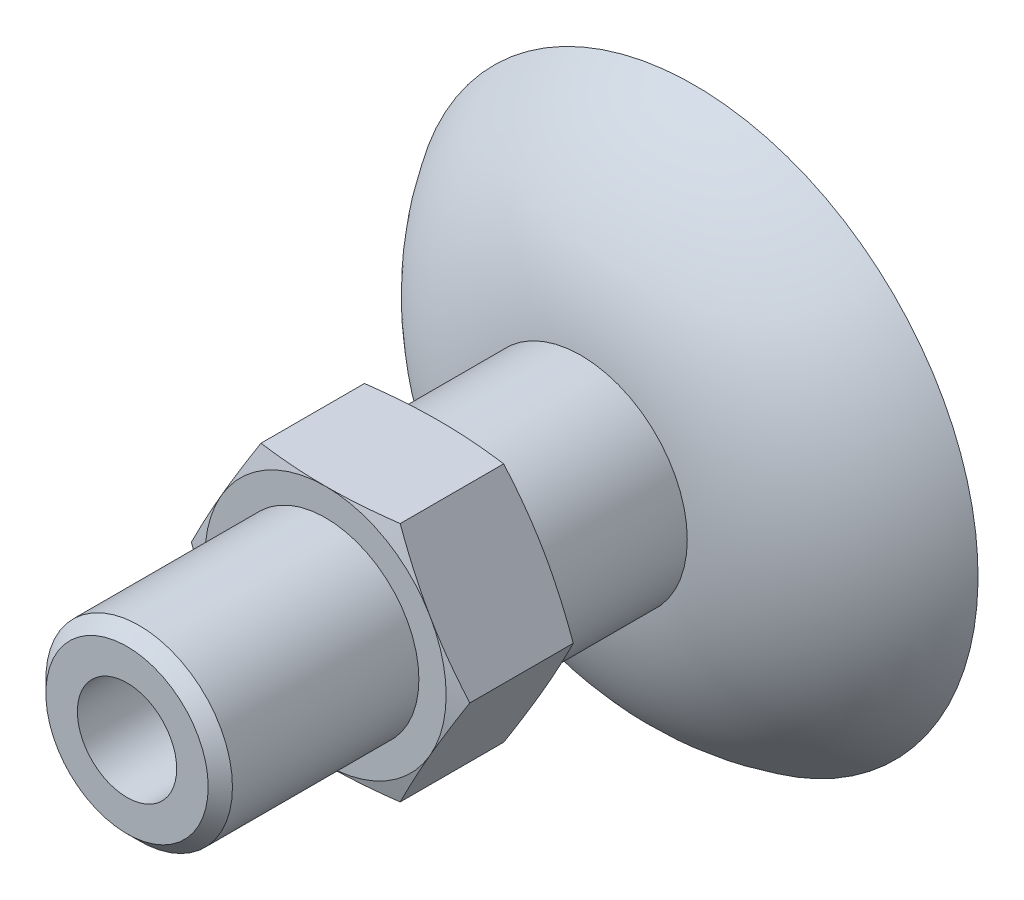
ISO-10303-21;
HEADER;
FILE_DESCRIPTION(('STEP AP214'),'2;1');
FILE_NAME('part.step','',(''),(''),'','','');
FILE_SCHEMA(('AUTOMOTIVE_DESIGN { 1 0 10303 214 1 1 1 1 }'));
ENDSEC;
DATA;
#1=APPLICATION_CONTEXT('core data for automotive mechanical design processes');
#2=APPLICATION_PROTOCOL_DEFINITION('international standard','automotive_design',2000,#1);
#3=PRODUCT_CONTEXT('',#1,'mechanical');
#4=PRODUCT('Part','Part','',(#3));
#5=PRODUCT_RELATED_PRODUCT_CATEGORY('part','',(#4));
#6=PRODUCT_DEFINITION_FORMATION('','',#4);
#7=PRODUCT_DEFINITION_CONTEXT('part definition',#1,'design');
#8=PRODUCT_DEFINITION('design','',#6,#7);
#9=PRODUCT_DEFINITION_SHAPE('','',#8);
#10=(LENGTH_UNIT() NAMED_UNIT(*) SI_UNIT(.MILLI.,.METRE.));
#11=(NAMED_UNIT(*) PLANE_ANGLE_UNIT() SI_UNIT($,.RADIAN.));
#12=(NAMED_UNIT(*) SI_UNIT($,.STERADIAN.) SOLID_ANGLE_UNIT());
#13=UNCERTAINTY_MEASURE_WITH_UNIT(LENGTH_MEASURE(1.E-05),#10,'distance_accuracy_value','');
#14=(GEOMETRIC_REPRESENTATION_CONTEXT(3) GLOBAL_UNCERTAINTY_ASSIGNED_CONTEXT((#13)) GLOBAL_UNIT_ASSIGNED_CONTEXT((#10,
#11,#12)) REPRESENTATION_CONTEXT('',''));
#15=CARTESIAN_POINT('',(0.,0.,0.));
#16=DIRECTION('',(0.,0.,1.));
#17=DIRECTION('',(1.,0.,0.));
#18=AXIS2_PLACEMENT_3D('',#15,#16,#17);
#19=CARTESIAN_POINT('',(9.81495457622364,0.,18.));
#20=DIRECTION('',(0.866025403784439,0.5,0.));
#21=DIRECTION('',(0.,0.,1.));
#22=AXIS2_PLACEMENT_3D('',#19,#20,#21);
#23=PLANE('',#22);
#24=DIRECTION('',(0.,0.,1.));
#25=VECTOR('',#24,1.);
#26=CARTESIAN_POINT('',(4.90747728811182,8.5,18.));
#27=LINE('',#26,#25);
#28=CARTESIAN_POINT('',(4.90747728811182,8.5,18.3523410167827));
#29=VERTEX_POINT('',#28);
#30=CARTESIAN_POINT('',(4.90747728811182,8.5,25.6476589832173));
#31=VERTEX_POINT('',#30);
#32=EDGE_CURVE('E449',#29,#31,#27,.T.);
#33=ORIENTED_EDGE('',*,*,#32,.T.);
#34=CARTESIAN_POINT('',(7.36121593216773,4.25000000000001,26.));
#35=CARTESIAN_POINT('',(7.25906175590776,4.42681371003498,26.0000283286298));
#36=CARTESIAN_POINT('',(7.15683049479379,4.60358298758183,25.9980853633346));
#37=CARTESIAN_POINT('',(6.95297562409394,4.95616774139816,25.9903015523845));
#38=CARTESIAN_POINT('',(6.85135160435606,5.1319834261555,25.9844809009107));
#39=CARTESIAN_POINT('',(6.64789890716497,5.4845122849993,25.9689468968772));
#40=CARTESIAN_POINT('',(6.54607179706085,5.66122549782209,25.9592139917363));
#41=CARTESIAN_POINT('',(6.34102365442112,6.01708320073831,25.9359159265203));
#42=CARTESIAN_POINT('',(6.23780425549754,6.19622503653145,25.92229626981));
#43=CARTESIAN_POINT('',(6.03399427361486,6.54934217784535,25.8919827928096));
#44=CARTESIAN_POINT('',(5.93340724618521,6.72332747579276,25.8753809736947));
#45=CARTESIAN_POINT('',(5.73149806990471,7.07269913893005,25.8388368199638));
#46=CARTESIAN_POINT('',(5.63017779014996,7.24808347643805,25.8188648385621));
#47=CARTESIAN_POINT('',(5.42622044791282,7.60127476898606,25.7756107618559));
#48=CARTESIAN_POINT('',(5.32358676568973,7.77907804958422,25.7522829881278));
#49=CARTESIAN_POINT('',(5.11643524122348,8.13798036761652,25.7023308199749));
#50=CARTESIAN_POINT('',(5.01192109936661,8.3190736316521,25.6756494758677));
#51=CARTESIAN_POINT('',(4.90747728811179,8.49999999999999,25.6476589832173));
#52=B_SPLINE_CURVE_WITH_KNOTS('',3,(#34,#35,#36,#37,#38,#39,#40,#41,#42,#43,#44,#45,#46,#47,#48,
#49,#50,#51),.UNSPECIFIED.,.F.,.F.,(4,2,2,2,2,2,2,2,4),(0.,0.612597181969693,1.22202876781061,
1.83454479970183,2.45611071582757,3.0610462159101,3.67161078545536,4.29145119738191,
4.92377991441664),.UNSPECIFIED.);
#53=CARTESIAN_POINT('',(7.36121593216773,4.25,26.));
#54=VERTEX_POINT('',#53);
#55=EDGE_CURVE('E482',#54,#31,#52,.T.);
#56=ORIENTED_EDGE('',*,*,#55,.F.);
#57=CARTESIAN_POINT('',(9.81495457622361,0.,25.6476589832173));
#58=CARTESIAN_POINT('',(9.71049903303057,0.180898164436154,25.6756469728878));
#59=CARTESIAN_POINT('',(9.60593547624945,0.36194148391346,25.7023256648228));
#60=CARTESIAN_POINT('',(9.39870838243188,0.720772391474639,25.7522744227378));
#61=CARTESIAN_POINT('',(9.29604797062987,0.898553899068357,25.7756012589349));
#62=CARTESIAN_POINT('',(9.09215663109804,1.25178452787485,25.8188552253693));
#63=CARTESIAN_POINT('',(8.99092720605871,1.42722891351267,25.8388278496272));
#64=CARTESIAN_POINT('',(8.78930184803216,1.77679219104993,25.875375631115));
#65=CARTESIAN_POINT('',(8.68890677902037,1.95090849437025,25.8919802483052));
#66=CARTESIAN_POINT('',(8.48499517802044,2.30396626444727,25.9222962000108));
#67=CARTESIAN_POINT('',(8.38146828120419,2.48290963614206,25.9359161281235));
#68=CARTESIAN_POINT('',(8.1758194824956,2.83839265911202,25.9592144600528));
#69=CARTESIAN_POINT('',(8.07369897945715,3.01492953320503,25.9689471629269));
#70=CARTESIAN_POINT('',(7.87012962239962,3.36739105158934,25.9844810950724));
#71=CARTESIAN_POINT('',(7.7686799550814,3.54331437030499,25.9903016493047));
#72=CARTESIAN_POINT('',(7.56525161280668,3.89617326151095,25.9980854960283));
#73=CARTESIAN_POINT('',(7.46327295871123,4.07310929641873,26.0000283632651));
#74=CARTESIAN_POINT('',(7.36121593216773,4.25000000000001,26.));
#75=B_SPLINE_CURVE_WITH_KNOTS('',3,(#57,#58,#59,#60,#61,#62,#63,#64,#65,#66,#67,#68,#69,#70,#71,
#72,#73,#74),.UNSPECIFIED.,.F.,.F.,(4,2,2,2,2,2,2,2,4),(0.,0.632272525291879,1.25209624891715,
1.86268065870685,2.46766909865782,3.08918081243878,3.70167875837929,4.31112844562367,
4.92377995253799),.UNSPECIFIED.);
#76=CARTESIAN_POINT('',(9.81495457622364,0.,25.6476589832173));
#77=VERTEX_POINT('',#76);
#78=EDGE_CURVE('E477',#77,#54,#75,.T.);
#79=ORIENTED_EDGE('',*,*,#78,.F.);
#80=DIRECTION('',(0.,0.,1.));
#81=VECTOR('',#80,1.);
#82=CARTESIAN_POINT('',(9.81495457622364,0.,18.));
#83=LINE('',#82,#81);
#84=CARTESIAN_POINT('',(9.81495457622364,0.,18.3523410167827));
#85=VERTEX_POINT('',#84);
#86=EDGE_CURVE('E440',#85,#77,#83,.T.);
#87=ORIENTED_EDGE('',*,*,#86,.F.);
#88=CARTESIAN_POINT('',(7.36121593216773,4.25000000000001,18.));
#89=CARTESIAN_POINT('',(7.46326400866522,4.07312503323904,17.9999716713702));
#90=CARTESIAN_POINT('',(7.56523506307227,3.89620552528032,18.0019146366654));
#91=CARTESIAN_POINT('',(7.7686549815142,3.54336965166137,18.0096984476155));
#92=CARTESIAN_POINT('',(7.87010382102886,3.36745282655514,18.0155190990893));
#93=CARTESIAN_POINT('',(8.07367641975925,3.01499319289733,18.0310531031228));
#94=CARTESIAN_POINT('',(8.17580099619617,2.83845172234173,18.0407860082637));
#95=CARTESIAN_POINT('',(8.3814587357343,2.48294597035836,18.0640840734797));
#96=CARTESIAN_POINT('',(8.48499041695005,2.30398443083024,18.07770373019));
#97=CARTESIAN_POINT('',(8.68889384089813,1.95092123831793,18.1080172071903));
#98=CARTESIAN_POINT('',(8.78927601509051,1.77681766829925,18.1246190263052));
#99=CARTESIAN_POINT('',(8.99088616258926,1.42727336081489,18.161163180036));
#100=CARTESIAN_POINT('',(9.09211331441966,1.25183525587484,18.1811351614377));
#101=CARTESIAN_POINT('',(9.29600727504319,0.898607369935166,18.2243892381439));
#102=CARTESIAN_POINT('',(9.39867259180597,0.720822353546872,18.247717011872));
#103=CARTESIAN_POINT('',(9.60591535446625,0.361972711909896,18.297669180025));
#104=CARTESIAN_POINT('',(9.71048965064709,0.180914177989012,18.3243505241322));
#105=CARTESIAN_POINT('',(9.81495457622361,0.,18.3523410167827));
#106=B_SPLINE_CURVE_WITH_KNOTS('',3,(#88,#89,#90,#91,#92,#93,#94,#95,#96,#97,#98,#99,#100,#101,
#102,#103,#104,#105),.UNSPECIFIED.,.F.,.F.,(4,2,2,2,2,2,2,2,4),(0.,0.612597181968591,
1.22202876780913,1.83454479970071,2.45611071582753,3.06104621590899,3.67161078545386,
4.29145119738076,4.92377991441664),.UNSPECIFIED.);
#107=CARTESIAN_POINT('',(7.36121593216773,4.25,18.));
#108=VERTEX_POINT('',#107);
#109=EDGE_CURVE('E499',#108,#85,#106,.T.);
#110=ORIENTED_EDGE('',*,*,#109,.F.);
#111=CARTESIAN_POINT('',(4.90747728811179,8.49999999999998,18.3523410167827));
#112=CARTESIAN_POINT('',(5.01191192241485,8.31908976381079,18.3243530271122));
#113=CARTESIAN_POINT('',(5.11641825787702,8.1380134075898,18.2976743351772));
#114=CARTESIAN_POINT('',(5.32356139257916,7.77913402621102,18.2477255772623));
#115=CARTESIAN_POINT('',(5.4261944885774,7.6013367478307,18.2243987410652));
#116=CARTESIAN_POINT('',(5.63015551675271,7.24814635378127,18.1811447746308));
#117=CARTESIAN_POINT('',(5.73148009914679,7.07275690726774,18.1611721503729));
#118=CARTESIAN_POINT('',(5.93339809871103,6.72336258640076,18.1246243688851));
#119=CARTESIAN_POINT('',(6.03398970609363,6.5493597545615,18.1080197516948));
#120=CARTESIAN_POINT('',(6.23779090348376,6.19623824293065,18.0777037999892));
#121=CARTESIAN_POINT('',(6.34099696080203,6.01710963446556,18.0640838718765));
#122=CARTESIAN_POINT('',(6.54602988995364,5.66127103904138,18.0407855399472));
#123=CARTESIAN_POINT('',(6.64785505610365,5.48456365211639,18.0310528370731));
#124=CARTESIAN_POINT('',(6.85131100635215,5.13203665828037,18.0155189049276));
#125=CARTESIAN_POINT('',(6.95294023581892,4.95621700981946,18.0096983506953));
#126=CARTESIAN_POINT('',(7.15681082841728,4.60361345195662,18.0019145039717));
#127=CARTESIAN_POINT('',(7.2590526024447,4.42682932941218,17.9999716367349));
#128=CARTESIAN_POINT('',(7.36121593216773,4.25000000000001,18.));
#129=B_SPLINE_CURVE_WITH_KNOTS('',3,(#111,#112,#113,#114,#115,#116,#117,#118,#119,#120,#121,
#122,#123,#124,#125,#126,#127,#128),.UNSPECIFIED.,.F.,.F.,(4,2,2,2,2,2,2,2,4),(0.,
0.632272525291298,1.25209624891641,1.86268065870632,2.46766909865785,3.08918081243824,
3.70167875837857,4.31112844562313,4.92377995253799),.UNSPECIFIED.);
#130=EDGE_CURVE('E246',#29,#108,#129,.T.);
#131=ORIENTED_EDGE('',*,*,#130,.F.);
#132=EDGE_LOOP('',(#33,#56,#79,#87,#110,#131));
#133=FACE_BOUND('',#132,.T.);
#134=ADVANCED_FACE('F16',(#133),#23,.T.);
#135=CARTESIAN_POINT('',(4.90747728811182,8.5,18.));
#136=DIRECTION('',(0.,1.,0.));
#137=DIRECTION('',(-1.,0.,0.));
#138=AXIS2_PLACEMENT_3D('',#135,#136,#137);
#139=PLANE('',#138);
#140=DIRECTION('',(0.,0.,1.));
#141=VECTOR('',#140,1.);
#142=CARTESIAN_POINT('',(-4.90747728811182,8.5,18.));
#143=LINE('',#142,#141);
#144=CARTESIAN_POINT('',(-4.90747728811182,8.5,18.3523410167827));
#145=VERTEX_POINT('',#144);
#146=CARTESIAN_POINT('',(-4.90747728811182,8.5,25.6476589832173));
#147=VERTEX_POINT('',#146);
#148=EDGE_CURVE('E446',#145,#147,#143,.T.);
#149=ORIENTED_EDGE('',*,*,#148,.T.);
#150=CARTESIAN_POINT('',(0.,8.50000000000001,26.));
#151=CARTESIAN_POINT('',(-0.204176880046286,8.49993864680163,26.000028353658));
#152=CARTESIAN_POINT('',(-0.408353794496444,8.49979499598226,25.9980841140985));
#153=CARTESIAN_POINT('',(-0.815609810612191,8.49956334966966,25.9902964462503));
#154=CARTESIAN_POINT('',(-1.01868928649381,8.49947507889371,25.9844726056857));
#155=CARTESIAN_POINT('',(-1.42576127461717,8.49956968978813,25.9689308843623));
#156=CARTESIAN_POINT('',(-1.62975301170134,8.49975399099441,25.959192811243));
#157=CARTESIAN_POINT('',(-2.04057387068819,8.50012267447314,25.9358833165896));
#158=CARTESIAN_POINT('',(-2.2473998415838,8.50030701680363,25.9222567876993));
#159=CARTESIAN_POINT('',(-2.65519984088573,8.50035684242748,25.891934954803));
#160=CARTESIAN_POINT('',(-2.85618081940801,8.50023081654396,25.8753326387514));
#161=CARTESIAN_POINT('',(-3.25970102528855,8.50003909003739,25.8387900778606));
#162=CARTESIAN_POINT('',(-3.46223759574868,8.49997395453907,25.8188205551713));
#163=CARTESIAN_POINT('',(-3.87004259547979,8.49991499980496,25.7755741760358));
#164=CARTESIAN_POINT('',(-4.07530619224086,8.49992227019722,25.7522520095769));
#165=CARTESIAN_POINT('',(-4.48960341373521,8.49995838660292,25.7023138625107));
#166=CARTESIAN_POINT('',(-4.69863023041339,8.49998766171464,25.6756412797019));
#167=CARTESIAN_POINT('',(-4.90747728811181,8.5,25.6476589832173));
#168=B_SPLINE_CURVE_WITH_KNOTS('',3,(#150,#151,#152,#153,#154,#155,#156,#157,#158,#159,#160,
#161,#162,#163,#164,#165,#166,#167),.UNSPECIFIED.,.F.,.F.,(4,2,2,2,2,2,2,2,4),(0.,
0.612521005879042,1.22197265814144,1.83460948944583,2.45640096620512,3.06137183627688,
3.67190327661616,4.29163625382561,4.92377827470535),.UNSPECIFIED.);
#169=CARTESIAN_POINT('',(0.,8.5,26.));
#170=VERTEX_POINT('',#169);
#171=EDGE_CURVE('E428',#170,#147,#168,.T.);
#172=ORIENTED_EDGE('',*,*,#171,.F.);
#173=CARTESIAN_POINT('',(4.9074772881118,8.50000000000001,25.6476589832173));
#174=CARTESIAN_POINT('',(4.69946398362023,8.49998809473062,25.6755294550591));
#175=CARTESIAN_POINT('',(4.49127255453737,8.49995395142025,25.7021019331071));
#176=CARTESIAN_POINT('',(4.07863628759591,8.49990114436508,25.7518671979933));
#177=CARTESIAN_POINT('',(3.87419820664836,8.49988218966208,25.7751161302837));
#178=CARTESIAN_POINT('',(3.46804768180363,8.49991440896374,25.8182431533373));
#179=CARTESIAN_POINT('',(3.26634005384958,8.49996454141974,25.8381663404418));
#180=CARTESIAN_POINT('',(2.86449662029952,8.50012588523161,25.8746436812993));
#181=CARTESIAN_POINT('',(2.66436348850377,8.50023652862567,25.8912272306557));
#182=CARTESIAN_POINT('',(2.2566345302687,8.5001722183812,25.9216619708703));
#183=CARTESIAN_POINT('',(2.04902969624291,8.49998682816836,25.9353931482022));
#184=CARTESIAN_POINT('',(1.63662828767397,8.4996327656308,25.9588816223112));
#185=CARTESIAN_POINT('',(1.43183486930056,8.49946388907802,25.9686939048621));
#186=CARTESIAN_POINT('',(1.02311579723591,8.49940595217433,25.98435467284));
#187=CARTESIAN_POINT('',(0.819190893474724,8.49951550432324,25.9902226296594));
#188=CARTESIAN_POINT('',(0.410177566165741,8.49978124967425,25.9980701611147));
#189=CARTESIAN_POINT('',(0.205088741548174,8.49993768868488,26.0000288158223));
#190=CARTESIAN_POINT('',(0.,8.50000000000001,26.));
#191=B_SPLINE_CURVE_WITH_KNOTS('',3,(#173,#174,#175,#176,#177,#178,#179,#180,#181,#182,#183,
#184,#185,#186,#187,#188,#189,#190),.UNSPECIFIED.,.F.,.F.,(4,2,2,2,2,2,2,2,4),(0.,
0.629618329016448,1.24686607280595,1.85490938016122,2.45734110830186,3.08148436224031,
3.69653362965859,4.30852392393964,4.92378048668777),.UNSPECIFIED.);
#192=EDGE_CURVE('E490',#31,#170,#191,.T.);
#193=ORIENTED_EDGE('',*,*,#192,.F.);
#194=ORIENTED_EDGE('',*,*,#32,.F.);
#195=CARTESIAN_POINT('',(0.,8.5,18.));
#196=CARTESIAN_POINT('',(0.204176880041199,8.49993864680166,17.999971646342));
#197=CARTESIAN_POINT('',(0.408353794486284,8.49979499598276,18.0019158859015));
#198=CARTESIAN_POINT('',(0.81560981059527,8.49956334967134,18.0097035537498));
#199=CARTESIAN_POINT('',(1.0186892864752,8.4994750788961,18.0155273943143));
#200=CARTESIAN_POINT('',(1.42576127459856,8.49956968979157,18.0310691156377));
#201=CARTESIAN_POINT('',(1.62975301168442,8.4997539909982,18.0408071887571));
#202=CARTESIAN_POINT('',(2.04057387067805,8.5001226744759,18.0641166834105));
#203=CARTESIAN_POINT('',(2.24739984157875,8.500307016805,18.0777432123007));
#204=CARTESIAN_POINT('',(2.65519984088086,8.50035684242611,18.1080650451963));
#205=CARTESIAN_POINT('',(2.85618081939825,8.50023081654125,18.1246673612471));
#206=CARTESIAN_POINT('',(3.25970102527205,8.50003909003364,18.1612099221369));
#207=CARTESIAN_POINT('',(3.46223759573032,8.49997395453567,18.181179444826));
#208=CARTESIAN_POINT('',(3.87004259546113,8.49991499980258,18.2244258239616));
#209=CARTESIAN_POINT('',(4.07530619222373,8.49992227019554,18.2477479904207));
#210=CARTESIAN_POINT('',(4.48960341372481,8.49995838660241,18.2976861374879));
#211=CARTESIAN_POINT('',(4.69863023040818,8.49998766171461,18.3243587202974));
#212=CARTESIAN_POINT('',(4.9074772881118,8.50000000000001,18.3523410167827));
#213=B_SPLINE_CURVE_WITH_KNOTS('',3,(#195,#196,#197,#198,#199,#200,#201,#202,#203,#204,#205,
#206,#207,#208,#209,#210,#211,#212),.UNSPECIFIED.,.F.,.F.,(4,2,2,2,2,2,2,2,4),(0.,
0.612521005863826,1.22197265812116,1.83460948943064,2.45640096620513,3.06137183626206,
3.67190327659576,4.29163625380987,4.92377827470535),.UNSPECIFIED.);
#214=CARTESIAN_POINT('',(0.,8.5,18.));
#215=VERTEX_POINT('',#214);
#216=EDGE_CURVE('E284',#215,#29,#213,.T.);
#217=ORIENTED_EDGE('',*,*,#216,.F.);
#218=CARTESIAN_POINT('',(-4.90747728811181,8.49999999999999,18.3523410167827));
#219=CARTESIAN_POINT('',(-4.69946398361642,8.49998809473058,18.3244705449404));
#220=CARTESIAN_POINT('',(-4.49127255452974,8.49995395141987,18.2978980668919));
#221=CARTESIAN_POINT('',(-4.07863628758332,8.49990114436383,18.248132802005));
#222=CARTESIAN_POINT('',(-3.87419820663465,8.49988218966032,18.2248838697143));
#223=CARTESIAN_POINT('',(-3.46804768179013,8.49991440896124,18.1817568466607));
#224=CARTESIAN_POINT('',(-3.26634005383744,8.499964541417,18.1618336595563));
#225=CARTESIAN_POINT('',(-2.86449662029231,8.50012588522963,18.1253563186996));
#226=CARTESIAN_POINT('',(-2.66436348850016,8.50023652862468,18.1087727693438));
#227=CARTESIAN_POINT('',(-2.25663453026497,8.50017221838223,18.0783380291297));
#228=CARTESIAN_POINT('',(-2.04902969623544,8.4999868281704,18.0646068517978));
#229=CARTESIAN_POINT('',(-1.63662828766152,8.49963276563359,18.0411183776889));
#230=CARTESIAN_POINT('',(-1.43183486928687,8.49946388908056,18.031306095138));
#231=CARTESIAN_POINT('',(-1.02311579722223,8.49940595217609,18.01564532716));
#232=CARTESIAN_POINT('',(-0.819190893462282,8.49951550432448,18.0097773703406));
#233=CARTESIAN_POINT('',(-0.410177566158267,8.49978124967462,18.0019298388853));
#234=CARTESIAN_POINT('',(-0.205088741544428,8.4999376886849,17.9999711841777));
#235=CARTESIAN_POINT('',(0.,8.5,18.));
#236=B_SPLINE_CURVE_WITH_KNOTS('',3,(#218,#219,#220,#221,#222,#223,#224,#225,#226,#227,#228,
#229,#230,#231,#232,#233,#234,#235),.UNSPECIFIED.,.F.,.F.,(4,2,2,2,2,2,2,2,4),(0.,
0.62961832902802,1.24686607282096,1.85490938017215,2.4573411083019,3.08148436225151,
3.69653362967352,4.30852392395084,4.9237804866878),.UNSPECIFIED.);
#237=EDGE_CURVE('E306',#145,#215,#236,.T.);
#238=ORIENTED_EDGE('',*,*,#237,.F.);
#239=EDGE_LOOP('',(#149,#172,#193,#194,#217,#238));
#240=FACE_BOUND('',#239,.T.);
#241=ADVANCED_FACE('F184',(#240),#139,.T.);
#242=CARTESIAN_POINT('',(-4.90747728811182,8.5,18.));
#243=DIRECTION('',(-0.866025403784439,0.5,0.));
#244=DIRECTION('',(0.,0.,-1.));
#245=AXIS2_PLACEMENT_3D('',#242,#243,#244);
#246=PLANE('',#245);
#247=DIRECTION('',(0.,0.,1.));
#248=VECTOR('',#247,1.);
#249=CARTESIAN_POINT('',(-9.81495457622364,0.,18.));
#250=LINE('',#249,#248);
#251=CARTESIAN_POINT('',(-9.81495457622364,0.,18.3523410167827));
#252=VERTEX_POINT('',#251);
#253=CARTESIAN_POINT('',(-9.81495457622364,0.,25.6476589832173));
#254=VERTEX_POINT('',#253);
#255=EDGE_CURVE('E142',#252,#254,#250,.T.);
#256=ORIENTED_EDGE('',*,*,#255,.T.);
#257=CARTESIAN_POINT('',(-7.36121593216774,4.25,26.));
#258=CARTESIAN_POINT('',(-7.46326400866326,4.0731250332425,26.0000283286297));
#259=CARTESIAN_POINT('',(-7.56523506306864,3.89620552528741,25.9980853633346));
#260=CARTESIAN_POINT('',(-7.76865498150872,3.54336965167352,25.9903015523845));
#261=CARTESIAN_POINT('',(-7.87010382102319,3.36745282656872,25.9844809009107));
#262=CARTESIAN_POINT('',(-8.07367641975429,3.01499319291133,25.9689468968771));
#263=CARTESIAN_POINT('',(-8.17580099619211,2.83845172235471,25.9592139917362));
#264=CARTESIAN_POINT('',(-8.38145873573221,2.48294597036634,25.9359159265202));
#265=CARTESIAN_POINT('',(-8.48499041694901,2.30398443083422,25.9222962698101));
#266=CARTESIAN_POINT('',(-8.68889384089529,1.95092123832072,25.8919827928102));
#267=CARTESIAN_POINT('',(-8.78927601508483,1.77681766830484,25.875380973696));
#268=CARTESIAN_POINT('',(-8.99088616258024,1.42727336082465,25.838836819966));
#269=CARTESIAN_POINT('',(-9.09211331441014,1.25183525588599,25.8188648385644));
#270=CARTESIAN_POINT('',(-9.29600727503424,0.898607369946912,25.7756107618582));
#271=CARTESIAN_POINT('',(-9.3986725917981,0.720822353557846,25.7522829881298));
#272=CARTESIAN_POINT('',(-9.60591535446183,0.361972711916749,25.7023308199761));
#273=CARTESIAN_POINT('',(-9.71048965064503,0.180914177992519,25.6756494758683));
#274=CARTESIAN_POINT('',(-9.81495457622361,0.,25.6476589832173));
#275=B_SPLINE_CURVE_WITH_KNOTS('',3,(#257,#258,#259,#260,#261,#262,#263,#264,#265,#266,#267,
#268,#269,#270,#271,#272,#273,#274),.UNSPECIFIED.,.F.,.F.,(4,2,2,2,2,2,2,2,4),(0.,
0.61259718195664,1.2220287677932,1.83454479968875,2.4561107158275,3.06104621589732,
3.67161078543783,4.2914511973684,4.92377991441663),.UNSPECIFIED.);
#276=CARTESIAN_POINT('',(-7.36121593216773,4.25,26.));
#277=VERTEX_POINT('',#276);
#278=EDGE_CURVE('E466',#277,#254,#275,.T.);
#279=ORIENTED_EDGE('',*,*,#278,.F.);
#280=CARTESIAN_POINT('',(-4.9074772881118,8.49999999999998,25.6476589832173));
#281=CARTESIAN_POINT('',(-5.01191192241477,8.31908976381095,25.6756469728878));
#282=CARTESIAN_POINT('',(-5.11641825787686,8.13801340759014,25.7023256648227));
#283=CARTESIAN_POINT('',(-5.32356139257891,7.77913402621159,25.7522744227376));
#284=CARTESIAN_POINT('',(-5.42619448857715,7.60133674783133,25.7756012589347));
#285=CARTESIAN_POINT('',(-5.63015551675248,7.24814635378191,25.8188552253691));
#286=CARTESIAN_POINT('',(-5.73148009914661,7.07275690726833,25.838827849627));
#287=CARTESIAN_POINT('',(-5.93339809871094,6.72336258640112,25.8753756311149));
#288=CARTESIAN_POINT('',(-6.03398970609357,6.5493597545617,25.8919802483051));
#289=CARTESIAN_POINT('',(-6.23779090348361,6.1962382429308,25.9222962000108));
#290=CARTESIAN_POINT('',(-6.34099696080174,6.01710963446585,25.9359161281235));
#291=CARTESIAN_POINT('',(-6.5460298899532,5.66127103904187,25.9592144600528));
#292=CARTESIAN_POINT('',(-6.64785505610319,5.48456365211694,25.9689471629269));
#293=CARTESIAN_POINT('',(-6.85131100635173,5.13203665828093,25.9844810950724));
#294=CARTESIAN_POINT('',(-6.95294023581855,4.95621700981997,25.9903016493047));
#295=CARTESIAN_POINT('',(-7.15681082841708,4.60361345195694,25.9980854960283));
#296=CARTESIAN_POINT('',(-7.25905260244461,4.42682932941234,26.0000283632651));
#297=CARTESIAN_POINT('',(-7.36121593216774,4.25,26.));
#298=B_SPLINE_CURVE_WITH_KNOTS('',3,(#280,#281,#282,#283,#284,#285,#286,#287,#288,#289,#290,
#291,#292,#293,#294,#295,#296,#297),.UNSPECIFIED.,.F.,.F.,(4,2,2,2,2,2,2,2,4),(0.,
0.632272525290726,1.25209624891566,1.86268065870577,2.46766909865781,3.08918081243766,
3.7016787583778,4.31112844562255,4.92377995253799),.UNSPECIFIED.);
#299=EDGE_CURVE('E422',#147,#277,#298,.T.);
#300=ORIENTED_EDGE('',*,*,#299,.F.);
#301=ORIENTED_EDGE('',*,*,#148,.F.);
#302=CARTESIAN_POINT('',(-7.36121593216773,4.25,18.));
#303=CARTESIAN_POINT('',(-7.25906175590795,4.42681371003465,17.9999716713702));
#304=CARTESIAN_POINT('',(-7.15683049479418,4.6035829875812,18.0019146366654));
#305=CARTESIAN_POINT('',(-6.95297562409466,4.95616774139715,18.0096984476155));
#306=CARTESIAN_POINT('',(-6.85135160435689,5.13198342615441,18.0155190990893));
#307=CARTESIAN_POINT('',(-6.64789890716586,5.48451228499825,18.0310531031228));
#308=CARTESIAN_POINT('',(-6.5460717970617,5.66122549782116,18.0407860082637));
#309=CARTESIAN_POINT('',(-6.34102365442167,6.01708320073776,18.0640840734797));
#310=CARTESIAN_POINT('',(-6.23780425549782,6.19622503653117,18.07770373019));
#311=CARTESIAN_POINT('',(-6.03399427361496,6.54934217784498,18.1080172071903));
#312=CARTESIAN_POINT('',(-5.93340724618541,6.72332747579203,18.1246190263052));
#313=CARTESIAN_POINT('',(-5.73149806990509,7.07269913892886,18.161163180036));
#314=CARTESIAN_POINT('',(-5.63017779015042,7.24808347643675,18.1811351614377));
#315=CARTESIAN_POINT('',(-5.42622044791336,7.60127476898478,18.2243892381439));
#316=CARTESIAN_POINT('',(-5.32358676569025,7.77907804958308,18.247717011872));
#317=CARTESIAN_POINT('',(-5.11643524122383,8.13798036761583,18.297669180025));
#318=CARTESIAN_POINT('',(-5.0119210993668,8.31907363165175,18.3243505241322));
#319=CARTESIAN_POINT('',(-4.9074772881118,8.49999999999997,18.3523410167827));
#320=B_SPLINE_CURVE_WITH_KNOTS('',3,(#302,#303,#304,#305,#306,#307,#308,#309,#310,#311,#312,
#313,#314,#315,#316,#317,#318,#319),.UNSPECIFIED.,.F.,.F.,(4,2,2,2,2,2,2,2,4),(0.,
0.612597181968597,1.22202876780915,1.83454479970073,2.45611071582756,3.06104621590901,
3.67161078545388,4.29145119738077,4.92377991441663),.UNSPECIFIED.);
#321=CARTESIAN_POINT('',(-7.36121593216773,4.25,18.));
#322=VERTEX_POINT('',#321);
#323=EDGE_CURVE('E297',#322,#145,#320,.T.);
#324=ORIENTED_EDGE('',*,*,#323,.F.);
#325=CARTESIAN_POINT('',(-9.81495457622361,0.,18.3523410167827));
#326=CARTESIAN_POINT('',(-9.71049903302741,0.180898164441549,18.3243530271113));
#327=CARTESIAN_POINT('',(-9.60593547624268,0.361941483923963,18.2976743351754));
#328=CARTESIAN_POINT('',(-9.39870838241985,0.720772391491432,18.2477255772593));
#329=CARTESIAN_POINT('',(-9.29604797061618,0.898553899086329,18.2243987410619));
#330=CARTESIAN_POINT('',(-9.09215663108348,1.2517845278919,18.1811447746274));
#331=CARTESIAN_POINT('',(-8.99092720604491,1.42722891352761,18.1611721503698));
#332=CARTESIAN_POINT('',(-8.78930184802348,1.7767921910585,18.1246243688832));
#333=CARTESIAN_POINT('',(-8.68890677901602,1.95090849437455,18.108019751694));
#334=CARTESIAN_POINT('',(-8.48499517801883,2.30396626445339,18.0777037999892));
#335=CARTESIAN_POINT('',(-8.38146828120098,2.48290963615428,18.0640838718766));
#336=CARTESIAN_POINT('',(-8.17581948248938,2.83839265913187,18.0407855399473));
#337=CARTESIAN_POINT('',(-8.07369897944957,3.01492953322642,18.0310528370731));
#338=CARTESIAN_POINT('',(-7.87012962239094,3.36739105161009,18.0155189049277));
#339=CARTESIAN_POINT('',(-7.76867995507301,3.54331437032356,18.0096983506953));
#340=CARTESIAN_POINT('',(-7.56525161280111,3.89617326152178,18.0019145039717));
#341=CARTESIAN_POINT('',(-7.46327295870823,4.07310929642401,17.9999716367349));
#342=CARTESIAN_POINT('',(-7.36121593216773,4.25,18.));
#343=B_SPLINE_CURVE_WITH_KNOTS('',3,(#325,#326,#327,#328,#329,#330,#331,#332,#333,#334,#335,
#336,#337,#338,#339,#340,#341,#342),.UNSPECIFIED.,.F.,.F.,(4,2,2,2,2,2,2,2,4),(0.,
0.632272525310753,1.25209624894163,1.86268065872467,2.46766909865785,3.08918081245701,
3.7016787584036,4.31112844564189,4.92377995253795),.UNSPECIFIED.);
#344=EDGE_CURVE('E298',#252,#322,#343,.T.);
#345=ORIENTED_EDGE('',*,*,#344,.F.);
#346=EDGE_LOOP('',(#256,#279,#300,#301,#324,#345));
#347=FACE_BOUND('',#346,.T.);
#348=ADVANCED_FACE('F216',(#347),#246,.T.);
#349=CARTESIAN_POINT('',(-9.81495457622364,0.,18.));
#350=DIRECTION('',(-0.866025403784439,-0.5,0.));
#351=DIRECTION('',(0.,0.,-1.));
#352=AXIS2_PLACEMENT_3D('',#349,#350,#351);
#353=PLANE('',#352);
#354=DIRECTION('',(0.,0.,1.));
#355=VECTOR('',#354,1.);
#356=CARTESIAN_POINT('',(-4.90747728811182,-8.5,18.));
#357=LINE('',#356,#355);
#358=CARTESIAN_POINT('',(-4.90747728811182,-8.5,18.3523410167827));
#359=VERTEX_POINT('',#358);
#360=CARTESIAN_POINT('',(-4.90747728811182,-8.5,25.6476589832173));
#361=VERTEX_POINT('',#360);
#362=EDGE_CURVE('E127',#359,#361,#357,.T.);
#363=ORIENTED_EDGE('',*,*,#362,.T.);
#364=CARTESIAN_POINT('',(-7.36121593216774,-4.25,26.));
#365=CARTESIAN_POINT('',(-7.25906175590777,-4.42681371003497,26.0000283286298));
#366=CARTESIAN_POINT('',(-7.15683049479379,-4.60358298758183,25.9980853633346));
#367=CARTESIAN_POINT('',(-6.95297562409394,-4.95616774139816,25.9903015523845));
#368=CARTESIAN_POINT('',(-6.85135160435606,-5.1319834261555,25.9844809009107));
#369=CARTESIAN_POINT('',(-6.64789890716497,-5.4845122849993,25.9689468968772));
#370=CARTESIAN_POINT('',(-6.54607179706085,-5.66122549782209,25.9592139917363));
#371=CARTESIAN_POINT('',(-6.34102365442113,-6.01708320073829,25.9359159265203));
#372=CARTESIAN_POINT('',(-6.23780425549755,-6.19622503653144,25.92229626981));
#373=CARTESIAN_POINT('',(-6.03399427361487,-6.54934217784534,25.8919827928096));
#374=CARTESIAN_POINT('',(-5.93340724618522,-6.72332747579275,25.8753809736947));
#375=CARTESIAN_POINT('',(-5.73149806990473,-7.07269913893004,25.8388368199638));
#376=CARTESIAN_POINT('',(-5.63017779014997,-7.24808347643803,25.8188648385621));
#377=CARTESIAN_POINT('',(-5.42622044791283,-7.60127476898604,25.7756107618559));
#378=CARTESIAN_POINT('',(-5.32358676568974,-7.77907804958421,25.7522829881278));
#379=CARTESIAN_POINT('',(-5.1164352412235,-8.13798036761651,25.7023308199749));
#380=CARTESIAN_POINT('',(-5.01192109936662,-8.31907363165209,25.6756494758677));
#381=CARTESIAN_POINT('',(-4.90747728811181,-8.49999999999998,25.6476589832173));
#382=B_SPLINE_CURVE_WITH_KNOTS('',3,(#364,#365,#366,#367,#368,#369,#370,#371,#372,#373,#374,
#375,#376,#377,#378,#379,#380,#381),.UNSPECIFIED.,.F.,.F.,(4,2,2,2,2,2,2,2,4),(0.,
0.612597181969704,1.22202876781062,1.83454479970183,2.45611071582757,3.06104621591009,
3.67161078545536,4.29145119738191,4.92377991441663),.UNSPECIFIED.);
#383=CARTESIAN_POINT('',(-7.36121593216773,-4.25,26.));
#384=VERTEX_POINT('',#383);
#385=EDGE_CURVE('E516',#384,#361,#382,.T.);
#386=ORIENTED_EDGE('',*,*,#385,.F.);
#387=CARTESIAN_POINT('',(-9.81495457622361,0.,25.6476589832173));
#388=CARTESIAN_POINT('',(-9.71049903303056,-0.180898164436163,25.6756469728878));
#389=CARTESIAN_POINT('',(-9.60593547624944,-0.361941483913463,25.7023256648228));
#390=CARTESIAN_POINT('',(-9.39870838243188,-0.720772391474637,25.7522744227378));
#391=CARTESIAN_POINT('',(-9.29604797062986,-0.898553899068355,25.7756012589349));
#392=CARTESIAN_POINT('',(-9.09215663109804,-1.25178452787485,25.8188552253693));
#393=CARTESIAN_POINT('',(-8.9909272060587,-1.42722891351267,25.8388278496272));
#394=CARTESIAN_POINT('',(-8.78930184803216,-1.77679219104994,25.875375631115));
#395=CARTESIAN_POINT('',(-8.68890677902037,-1.95090849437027,25.8919802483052));
#396=CARTESIAN_POINT('',(-8.48499517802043,-2.30396626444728,25.9222962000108));
#397=CARTESIAN_POINT('',(-8.38146828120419,-2.48290963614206,25.9359161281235));
#398=CARTESIAN_POINT('',(-8.1758194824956,-2.83839265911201,25.9592144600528));
#399=CARTESIAN_POINT('',(-8.07369897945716,-3.01492953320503,25.9689471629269));
#400=CARTESIAN_POINT('',(-7.87012962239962,-3.36739105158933,25.9844810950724));
#401=CARTESIAN_POINT('',(-7.76867995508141,-3.54331437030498,25.9903016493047));
#402=CARTESIAN_POINT('',(-7.56525161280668,-3.89617326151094,25.9980854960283));
#403=CARTESIAN_POINT('',(-7.46327295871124,-4.07310929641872,26.0000283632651));
#404=CARTESIAN_POINT('',(-7.36121593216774,-4.25,26.));
#405=B_SPLINE_CURVE_WITH_KNOTS('',3,(#387,#388,#389,#390,#391,#392,#393,#394,#395,#396,#397,
#398,#399,#400,#401,#402,#403,#404),.UNSPECIFIED.,.F.,.F.,(4,2,2,2,2,2,2,2,4),(0.,
0.632272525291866,1.25209624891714,1.86268065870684,2.46766909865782,3.08918081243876,
3.70167875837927,4.31112844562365,4.92377995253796),.UNSPECIFIED.);
#406=EDGE_CURVE('E403',#254,#384,#405,.T.);
#407=ORIENTED_EDGE('',*,*,#406,.F.);
#408=ORIENTED_EDGE('',*,*,#255,.F.);
#409=CARTESIAN_POINT('',(-7.36121593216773,-4.24999999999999,18.));
#410=CARTESIAN_POINT('',(-7.46326400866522,-4.07312503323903,17.9999716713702));
#411=CARTESIAN_POINT('',(-7.56523506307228,-3.89620552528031,18.0019146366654));
#412=CARTESIAN_POINT('',(-7.76865498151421,-3.54336965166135,18.0096984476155));
#413=CARTESIAN_POINT('',(-7.87010382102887,-3.36745282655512,18.0155190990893));
#414=CARTESIAN_POINT('',(-8.07367641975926,-3.0149931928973,18.0310531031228));
#415=CARTESIAN_POINT('',(-8.17580099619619,-2.83845172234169,18.0407860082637));
#416=CARTESIAN_POINT('',(-8.38145873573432,-2.48294597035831,18.0640840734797));
#417=CARTESIAN_POINT('',(-8.48499041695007,-2.30398443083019,18.07770373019));
#418=CARTESIAN_POINT('',(-8.68889384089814,-1.95092123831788,18.1080172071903));
#419=CARTESIAN_POINT('',(-8.78927601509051,-1.7768176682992,18.1246190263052));
#420=CARTESIAN_POINT('',(-8.99088616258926,-1.42727336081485,18.161163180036));
#421=CARTESIAN_POINT('',(-9.09211331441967,-1.25183525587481,18.1811351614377));
#422=CARTESIAN_POINT('',(-9.29600727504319,-0.898607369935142,18.2243892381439));
#423=CARTESIAN_POINT('',(-9.39867259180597,-0.720822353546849,18.247717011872));
#424=CARTESIAN_POINT('',(-9.60591535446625,-0.361972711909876,18.297669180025));
#425=CARTESIAN_POINT('',(-9.71048965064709,-0.180914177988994,18.3243505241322));
#426=CARTESIAN_POINT('',(-9.81495457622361,0.,18.3523410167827));
#427=B_SPLINE_CURVE_WITH_KNOTS('',3,(#409,#410,#411,#412,#413,#414,#415,#416,#417,#418,#419,
#420,#421,#422,#423,#424,#425,#426),.UNSPECIFIED.,.F.,.F.,(4,2,2,2,2,2,2,2,4),(0.,
0.612597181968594,1.22202876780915,1.83454479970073,2.45611071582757,3.06104621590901,
3.67161078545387,4.29145119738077,4.92377991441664),.UNSPECIFIED.);
#428=CARTESIAN_POINT('',(-7.36121593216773,-4.25,18.));
#429=VERTEX_POINT('',#428);
#430=EDGE_CURVE('E150',#429,#252,#427,.T.);
#431=ORIENTED_EDGE('',*,*,#430,.F.);
#432=CARTESIAN_POINT('',(-4.9074772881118,-8.49999999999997,18.3523410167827));
#433=CARTESIAN_POINT('',(-5.01191192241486,-8.31908976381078,18.3243530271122));
#434=CARTESIAN_POINT('',(-5.11641825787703,-8.1380134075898,18.2976743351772));
#435=CARTESIAN_POINT('',(-5.32356139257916,-7.77913402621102,18.2477255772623));
#436=CARTESIAN_POINT('',(-5.42619448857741,-7.6013367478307,18.2243987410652));
#437=CARTESIAN_POINT('',(-5.63015551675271,-7.24814635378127,18.1811447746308));
#438=CARTESIAN_POINT('',(-5.73148009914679,-7.07275690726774,18.1611721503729));
#439=CARTESIAN_POINT('',(-5.93339809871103,-6.72336258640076,18.1246243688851));
#440=CARTESIAN_POINT('',(-6.03398970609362,-6.54935975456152,18.1080197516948));
#441=CARTESIAN_POINT('',(-6.23779090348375,-6.19623824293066,18.0777037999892));
#442=CARTESIAN_POINT('',(-6.34099696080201,-6.01710963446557,18.0640838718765));
#443=CARTESIAN_POINT('',(-6.54602988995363,-5.66127103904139,18.0407855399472));
#444=CARTESIAN_POINT('',(-6.64785505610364,-5.4845636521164,18.0310528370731));
#445=CARTESIAN_POINT('',(-6.85131100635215,-5.13203665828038,18.0155189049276));
#446=CARTESIAN_POINT('',(-6.95294023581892,-4.95621700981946,18.0096983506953));
#447=CARTESIAN_POINT('',(-7.15681082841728,-4.60361345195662,18.0019145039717));
#448=CARTESIAN_POINT('',(-7.2590526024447,-4.42682932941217,17.9999716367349));
#449=CARTESIAN_POINT('',(-7.36121593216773,-4.24999999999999,18.));
#450=B_SPLINE_CURVE_WITH_KNOTS('',3,(#432,#433,#434,#435,#436,#437,#438,#439,#440,#441,#442,
#443,#444,#445,#446,#447,#448,#449),.UNSPECIFIED.,.F.,.F.,(4,2,2,2,2,2,2,2,4),(0.,
0.632272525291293,1.25209624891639,1.8626806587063,2.46766909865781,3.08918081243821,
3.70167875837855,4.31112844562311,4.92377995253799),.UNSPECIFIED.);
#451=EDGE_CURVE('E146',#359,#429,#450,.T.);
#452=ORIENTED_EDGE('',*,*,#451,.F.);
#453=EDGE_LOOP('',(#363,#386,#407,#408,#431,#452));
#454=FACE_BOUND('',#453,.T.);
#455=ADVANCED_FACE('F148',(#454),#353,.T.);
#456=CARTESIAN_POINT('',(-4.90747728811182,-8.5,18.));
#457=DIRECTION('',(0.,-1.,0.));
#458=DIRECTION('',(0.,0.,-1.));
#459=AXIS2_PLACEMENT_3D('',#456,#457,#458);
#460=PLANE('',#459);
#461=DIRECTION('',(0.,0.,1.));
#462=VECTOR('',#461,1.);
#463=CARTESIAN_POINT('',(4.90747728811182,-8.5,18.));
#464=LINE('',#463,#462);
#465=CARTESIAN_POINT('',(4.90747728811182,-8.5,18.3523410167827));
#466=VERTEX_POINT('',#465);
#467=CARTESIAN_POINT('',(4.90747728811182,-8.5,25.6476589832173));
#468=VERTEX_POINT('',#467);
#469=EDGE_CURVE('E143',#466,#468,#464,.T.);
#470=ORIENTED_EDGE('',*,*,#469,.T.);
#471=CARTESIAN_POINT('',(0.,-8.50000000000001,26.));
#472=CARTESIAN_POINT('',(0.204176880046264,-8.49993864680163,26.000028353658));
#473=CARTESIAN_POINT('',(0.408353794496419,-8.49979499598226,25.9980841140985));
#474=CARTESIAN_POINT('',(0.815609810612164,-8.49956334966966,25.9902964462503));
#475=CARTESIAN_POINT('',(1.01868928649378,-8.49947507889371,25.9844726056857));
#476=CARTESIAN_POINT('',(1.42576127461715,-8.49956968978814,25.9689308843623));
#477=CARTESIAN_POINT('',(1.62975301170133,-8.49975399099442,25.959192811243));
#478=CARTESIAN_POINT('',(2.04057387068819,-8.50012267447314,25.9358833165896));
#479=CARTESIAN_POINT('',(2.24739984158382,-8.50030701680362,25.9222567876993));
#480=CARTESIAN_POINT('',(2.65519984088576,-8.50035684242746,25.891934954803));
#481=CARTESIAN_POINT('',(2.85618081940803,-8.50023081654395,25.8753326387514));
#482=CARTESIAN_POINT('',(3.25970102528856,-8.50003909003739,25.8387900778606));
#483=CARTESIAN_POINT('',(3.46223759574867,-8.49997395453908,25.8188205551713));
#484=CARTESIAN_POINT('',(3.87004259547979,-8.49991499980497,25.7755741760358));
#485=CARTESIAN_POINT('',(4.07530619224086,-8.49992227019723,25.7522520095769));
#486=CARTESIAN_POINT('',(4.4896034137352,-8.49995838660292,25.7023138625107));
#487=CARTESIAN_POINT('',(4.69863023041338,-8.49998766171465,25.6756412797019));
#488=CARTESIAN_POINT('',(4.9074772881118,-8.50000000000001,25.6476589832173));
#489=B_SPLINE_CURVE_WITH_KNOTS('',3,(#471,#472,#473,#474,#475,#476,#477,#478,#479,#480,#481,
#482,#483,#484,#485,#486,#487,#488),.UNSPECIFIED.,.F.,.F.,(4,2,2,2,2,2,2,2,4),(0.,
0.612521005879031,1.22197265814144,1.83460948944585,2.45640096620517,3.06137183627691,
3.67190327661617,4.29163625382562,4.92377827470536),.UNSPECIFIED.);
#490=CARTESIAN_POINT('',(0.,-8.5,26.));
#491=VERTEX_POINT('',#490);
#492=EDGE_CURVE('E420',#491,#468,#489,.T.);
#493=ORIENTED_EDGE('',*,*,#492,.F.);
#494=CARTESIAN_POINT('',(-4.90747728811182,-8.5,25.6476589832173));
#495=CARTESIAN_POINT('',(-4.69946398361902,-8.4999880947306,25.6755294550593));
#496=CARTESIAN_POINT('',(-4.49127255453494,-8.49995395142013,25.7021019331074));
#497=CARTESIAN_POINT('',(-4.07863628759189,-8.49990114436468,25.7518671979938));
#498=CARTESIAN_POINT('',(-3.87419820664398,-8.49988218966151,25.7751161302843));
#499=CARTESIAN_POINT('',(-3.46804768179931,-8.49991440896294,25.8182431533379));
#500=CARTESIAN_POINT('',(-3.2663400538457,-8.49996454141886,25.8381663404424));
#501=CARTESIAN_POINT('',(-2.86449662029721,-8.50012588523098,25.8746436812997));
#502=CARTESIAN_POINT('',(-2.66436348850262,-8.50023652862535,25.8912272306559));
#503=CARTESIAN_POINT('',(-2.25663453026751,-8.50017221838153,25.9216619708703));
#504=CARTESIAN_POINT('',(-2.04902969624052,-8.49998682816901,25.9353931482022));
#505=CARTESIAN_POINT('',(-1.63662828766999,-8.49963276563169,25.9588816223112));
#506=CARTESIAN_POINT('',(-1.43183486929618,-8.49946388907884,25.9686939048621));
#507=CARTESIAN_POINT('',(-1.02311579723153,-8.4994059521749,25.98435467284));
#508=CARTESIAN_POINT('',(-0.819190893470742,-8.49951550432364,25.9902226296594));
#509=CARTESIAN_POINT('',(-0.410177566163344,-8.49978124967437,25.9980701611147));
#510=CARTESIAN_POINT('',(-0.205088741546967,-8.49993768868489,26.0000288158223));
#511=CARTESIAN_POINT('',(0.,-8.50000000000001,26.));
#512=B_SPLINE_CURVE_WITH_KNOTS('',3,(#494,#495,#496,#497,#498,#499,#500,#501,#502,#503,#504,
#505,#506,#507,#508,#509,#510,#511),.UNSPECIFIED.,.F.,.F.,(4,2,2,2,2,2,2,2,4),(0.,
0.629618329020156,1.24686607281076,1.85490938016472,2.45734110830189,3.08148436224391,
3.69653362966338,4.30852392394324,4.92378048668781),.UNSPECIFIED.);
#513=EDGE_CURVE('E136',#361,#491,#512,.T.);
#514=ORIENTED_EDGE('',*,*,#513,.F.);
#515=ORIENTED_EDGE('',*,*,#362,.F.);
#516=CARTESIAN_POINT('',(0.,-8.5,18.));
#517=CARTESIAN_POINT('',(-0.204176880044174,-8.49993864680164,17.999971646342));
#518=CARTESIAN_POINT('',(-0.408353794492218,-8.49979499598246,18.0019158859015));
#519=CARTESIAN_POINT('',(-0.815609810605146,-8.49956334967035,18.0097035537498));
#520=CARTESIAN_POINT('',(-1.01868928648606,-8.4994750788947,18.0155273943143));
#521=CARTESIAN_POINT('',(-1.42576127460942,-8.49956968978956,18.0310691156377));
#522=CARTESIAN_POINT('',(-1.62975301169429,-8.49975399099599,18.040807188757));
#523=CARTESIAN_POINT('',(-2.04057387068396,-8.50012267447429,18.0641166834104));
#524=CARTESIAN_POINT('',(-2.24739984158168,-8.5003070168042,18.0777432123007));
#525=CARTESIAN_POINT('',(-2.65519984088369,-8.50035684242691,18.1080650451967));
#526=CARTESIAN_POINT('',(-2.85618081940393,-8.50023081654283,18.124667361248));
#527=CARTESIAN_POINT('',(-3.25970102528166,-8.50003909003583,18.1612099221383));
#528=CARTESIAN_POINT('',(-3.46223759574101,-8.49997395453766,18.1811794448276));
#529=CARTESIAN_POINT('',(-3.87004259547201,-8.49991499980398,18.2244258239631));
#530=CARTESIAN_POINT('',(-4.07530619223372,-8.49992227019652,18.2477479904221));
#531=CARTESIAN_POINT('',(-4.48960341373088,-8.49995838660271,18.2976861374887));
#532=CARTESIAN_POINT('',(-4.69863023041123,-8.49998766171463,18.3243587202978));
#533=CARTESIAN_POINT('',(-4.90747728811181,-8.5,18.3523410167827));
#534=B_SPLINE_CURVE_WITH_KNOTS('',3,(#516,#517,#518,#519,#520,#521,#522,#523,#524,#525,#526,
#527,#528,#529,#530,#531,#532,#533),.UNSPECIFIED.,.F.,.F.,(4,2,2,2,2,2,2,2,4),(0.,
0.612521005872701,1.22197265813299,1.83460948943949,2.4564009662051,3.06137183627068,
3.67190327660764,4.29163625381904,4.92377827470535),.UNSPECIFIED.);
#535=CARTESIAN_POINT('',(0.,-8.5,18.));
#536=VERTEX_POINT('',#535);
#537=EDGE_CURVE('E132',#536,#359,#534,.T.);
#538=ORIENTED_EDGE('',*,*,#537,.F.);
#539=CARTESIAN_POINT('',(4.9074772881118,-8.5,18.3523410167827));
#540=CARTESIAN_POINT('',(4.6994639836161,-8.49998809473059,18.3244705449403));
#541=CARTESIAN_POINT('',(4.49127255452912,-8.49995395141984,18.2978980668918));
#542=CARTESIAN_POINT('',(4.07863628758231,-8.49990114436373,18.2481328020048));
#543=CARTESIAN_POINT('',(3.87419820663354,-8.49988218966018,18.2248838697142));
#544=CARTESIAN_POINT('',(3.46804768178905,-8.49991440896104,18.1817568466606));
#545=CARTESIAN_POINT('',(3.26634005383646,-8.49996454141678,18.1618336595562));
#546=CARTESIAN_POINT('',(2.86449662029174,-8.50012588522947,18.1253563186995));
#547=CARTESIAN_POINT('',(2.66436348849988,-8.5002365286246,18.1087727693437));
#548=CARTESIAN_POINT('',(2.25663453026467,-8.50017221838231,18.0783380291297));
#549=CARTESIAN_POINT('',(2.04902969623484,-8.49998682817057,18.0646068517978));
#550=CARTESIAN_POINT('',(1.63662828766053,-8.49963276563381,18.0411183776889));
#551=CARTESIAN_POINT('',(1.43183486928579,-8.49946388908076,18.031306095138));
#552=CARTESIAN_POINT('',(1.02311579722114,-8.49940595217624,18.01564532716));
#553=CARTESIAN_POINT('',(0.819190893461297,-8.49951550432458,18.0097773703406));
#554=CARTESIAN_POINT('',(0.410177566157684,-8.49978124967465,18.0019298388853));
#555=CARTESIAN_POINT('',(0.205088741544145,-8.49993768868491,17.9999711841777));
#556=CARTESIAN_POINT('',(0.,-8.5,18.));
#557=B_SPLINE_CURVE_WITH_KNOTS('',3,(#539,#540,#541,#542,#543,#544,#545,#546,#547,#548,#549,
#550,#551,#552,#553,#554,#555,#556),.UNSPECIFIED.,.F.,.F.,(4,2,2,2,2,2,2,2,4),(0.,
0.629618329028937,1.24686607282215,1.854909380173,2.45734110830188,3.08148436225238,
3.69653362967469,4.30852392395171,4.92378048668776),.UNSPECIFIED.);
#558=EDGE_CURVE('E203',#466,#536,#557,.T.);
#559=ORIENTED_EDGE('',*,*,#558,.F.);
#560=EDGE_LOOP('',(#470,#493,#514,#515,#538,#559));
#561=FACE_BOUND('',#560,.T.);
#562=ADVANCED_FACE('F129',(#561),#460,.T.);
#563=CARTESIAN_POINT('',(4.90747728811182,-8.5,18.));
#564=DIRECTION('',(0.866025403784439,-0.5,0.));
#565=DIRECTION('',(0.5,0.866025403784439,0.));
#566=AXIS2_PLACEMENT_3D('',#563,#564,#565);
#567=PLANE('',#566);
#568=ORIENTED_EDGE('',*,*,#86,.T.);
#569=CARTESIAN_POINT('',(7.36121593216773,-4.25000000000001,26.));
#570=CARTESIAN_POINT('',(7.46326400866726,-4.07312503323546,26.0000283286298));
#571=CARTESIAN_POINT('',(7.56523506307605,-3.89620552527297,25.9980853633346));
#572=CARTESIAN_POINT('',(7.76865498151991,-3.54336965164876,25.9903015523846));
#573=CARTESIAN_POINT('',(7.87010382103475,-3.36745282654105,25.9844809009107));
#574=CARTESIAN_POINT('',(8.0736764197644,-3.0149931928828,25.9689468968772));
#575=CARTESIAN_POINT('',(8.1758009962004,-2.83845172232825,25.9592139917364));
#576=CARTESIAN_POINT('',(8.38145873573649,-2.48294597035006,25.9359159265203));
#577=CARTESIAN_POINT('',(8.48499041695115,-2.30398443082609,25.92229626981));
#578=CARTESIAN_POINT('',(8.68889384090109,-1.95092123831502,25.8919827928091));
#579=CARTESIAN_POINT('',(8.7892760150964,-1.77681766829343,25.8753809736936));
#580=CARTESIAN_POINT('',(8.99088616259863,-1.42727336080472,25.838836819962));
#581=CARTESIAN_POINT('',(9.09211331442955,-1.25183525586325,25.8188648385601));
#582=CARTESIAN_POINT('',(9.29600727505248,-0.898607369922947,25.7756107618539));
#583=CARTESIAN_POINT('',(9.39867259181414,-0.720822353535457,25.752282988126));
#584=CARTESIAN_POINT('',(9.60591535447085,-0.361972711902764,25.7023308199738));
#585=CARTESIAN_POINT('',(9.71048965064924,-0.180914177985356,25.6756494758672));
#586=CARTESIAN_POINT('',(9.81495457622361,0.,25.6476589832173));
#587=B_SPLINE_CURVE_WITH_KNOTS('',3,(#569,#570,#571,#572,#573,#574,#575,#576,#577,#578,#579,
#580,#581,#582,#583,#584,#585,#586),.UNSPECIFIED.,.F.,.F.,(4,2,2,2,2,2,2,2,4),(0.,
0.612597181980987,1.22202876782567,1.83454479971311,2.45611071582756,3.06104621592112,
3.67161078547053,4.29145119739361,4.92377991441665),.UNSPECIFIED.);
#588=CARTESIAN_POINT('',(7.36121593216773,-4.25,26.));
#589=VERTEX_POINT('',#588);
#590=EDGE_CURVE('E483',#589,#77,#587,.T.);
#591=ORIENTED_EDGE('',*,*,#590,.F.);
#592=CARTESIAN_POINT('',(4.90747728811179,-8.49999999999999,25.6476589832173));
#593=CARTESIAN_POINT('',(5.01191192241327,-8.31908976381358,25.6756469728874));
#594=CARTESIAN_POINT('',(5.11641825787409,-8.13801340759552,25.7023256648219));
#595=CARTESIAN_POINT('',(5.32356139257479,-7.7791340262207,25.7522744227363));
#596=CARTESIAN_POINT('',(5.42619448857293,-7.60133674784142,25.7756012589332));
#597=CARTESIAN_POINT('',(5.63015551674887,-7.24814635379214,25.8188552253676));
#598=CARTESIAN_POINT('',(5.7314800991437,-7.07275690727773,25.8388278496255));
#599=CARTESIAN_POINT('',(5.93339809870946,-6.72336258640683,25.875375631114));
#600=CARTESIAN_POINT('',(6.03398970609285,-6.54935975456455,25.8919802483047));
#601=CARTESIAN_POINT('',(6.23779090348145,-6.19623824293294,25.9222962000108));
#602=CARTESIAN_POINT('',(6.34099696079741,-6.01710963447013,25.9359161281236));
#603=CARTESIAN_POINT('',(6.54602988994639,-5.66127103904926,25.9592144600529));
#604=CARTESIAN_POINT('',(6.64785505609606,-5.48456365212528,25.968947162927));
#605=CARTESIAN_POINT('',(6.85131100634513,-5.13203665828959,25.9844810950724));
#606=CARTESIAN_POINT('',(6.9529402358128,-4.95621700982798,25.9903016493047));
#607=CARTESIAN_POINT('',(7.15681082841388,-4.60361345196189,25.9980854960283));
#608=CARTESIAN_POINT('',(7.25905260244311,-4.42682932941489,26.0000283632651));
#609=CARTESIAN_POINT('',(7.36121593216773,-4.25000000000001,26.));
#610=B_SPLINE_CURVE_WITH_KNOTS('',3,(#592,#593,#594,#595,#596,#597,#598,#599,#600,#601,#602,
#603,#604,#605,#606,#607,#608,#609),.UNSPECIFIED.,.F.,.F.,(4,2,2,2,2,2,2,2,4),(0.,
0.632272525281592,1.25209624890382,1.86268065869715,2.46766909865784,3.08918081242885,
3.70167875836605,4.31112844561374,4.923779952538),.UNSPECIFIED.);
#611=EDGE_CURVE('E435',#468,#589,#610,.T.);
#612=ORIENTED_EDGE('',*,*,#611,.F.);
#613=ORIENTED_EDGE('',*,*,#469,.F.);
#614=CARTESIAN_POINT('',(7.36121593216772,-4.25000000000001,18.));
#615=CARTESIAN_POINT('',(7.25906175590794,-4.42681371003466,17.9999716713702));
#616=CARTESIAN_POINT('',(7.15683049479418,-4.60358298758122,18.0019146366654));
#617=CARTESIAN_POINT('',(6.95297562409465,-4.95616774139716,18.0096984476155));
#618=CARTESIAN_POINT('',(6.85135160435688,-5.13198342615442,18.0155190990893));
#619=CARTESIAN_POINT('',(6.64789890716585,-5.48451228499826,18.0310531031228));
#620=CARTESIAN_POINT('',(6.54607179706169,-5.66122549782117,18.0407860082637));
#621=CARTESIAN_POINT('',(6.34102365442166,-6.01708320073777,18.0640840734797));
#622=CARTESIAN_POINT('',(6.2378042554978,-6.19622503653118,18.07770373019));
#623=CARTESIAN_POINT('',(6.03399427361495,-6.54934217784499,18.1080172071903));
#624=CARTESIAN_POINT('',(5.9334072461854,-6.72332747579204,18.1246190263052));
#625=CARTESIAN_POINT('',(5.73149806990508,-7.07269913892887,18.161163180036));
#626=CARTESIAN_POINT('',(5.63017779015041,-7.24808347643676,18.1811351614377));
#627=CARTESIAN_POINT('',(5.42622044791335,-7.60127476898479,18.2243892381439));
#628=CARTESIAN_POINT('',(5.32358676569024,-7.77907804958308,18.247717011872));
#629=CARTESIAN_POINT('',(5.11643524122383,-8.13798036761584,18.297669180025));
#630=CARTESIAN_POINT('',(5.01192109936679,-8.31907363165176,18.3243505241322));
#631=CARTESIAN_POINT('',(4.90747728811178,-8.49999999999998,18.3523410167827));
#632=B_SPLINE_CURVE_WITH_KNOTS('',3,(#614,#615,#616,#617,#618,#619,#620,#621,#622,#623,#624,
#625,#626,#627,#628,#629,#630,#631),.UNSPECIFIED.,.F.,.F.,(4,2,2,2,2,2,2,2,4),(0.,
0.612597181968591,1.22202876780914,1.83454479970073,2.45611071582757,3.06104621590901,
3.67161078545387,4.29145119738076,4.92377991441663),.UNSPECIFIED.);
#633=CARTESIAN_POINT('',(7.36121593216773,-4.25,18.));
#634=VERTEX_POINT('',#633);
#635=EDGE_CURVE('E471',#634,#466,#632,.T.);
#636=ORIENTED_EDGE('',*,*,#635,.F.);
#637=CARTESIAN_POINT('',(9.81495457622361,0.,18.3523410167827));
#638=CARTESIAN_POINT('',(9.71049903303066,-0.18089816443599,18.3243530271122));
#639=CARTESIAN_POINT('',(9.60593547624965,-0.361941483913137,18.2976743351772));
#640=CARTESIAN_POINT('',(9.39870838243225,-0.720772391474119,18.2477255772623));
#641=CARTESIAN_POINT('',(9.29604797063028,-0.8985538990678,18.2243987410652));
#642=CARTESIAN_POINT('',(9.09215663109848,-1.25178452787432,18.1811447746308));
#643=CARTESIAN_POINT('',(8.99092720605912,-1.4272289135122,18.1611721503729));
#644=CARTESIAN_POINT('',(8.78930184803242,-1.77679219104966,18.1246243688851));
#645=CARTESIAN_POINT('',(8.6889067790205,-1.95090849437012,18.1080197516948));
#646=CARTESIAN_POINT('',(8.48499517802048,-2.30396626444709,18.0777037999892));
#647=CARTESIAN_POINT('',(8.38146828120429,-2.48290963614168,18.0640838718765));
#648=CARTESIAN_POINT('',(8.17581948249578,-2.83839265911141,18.0407855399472));
#649=CARTESIAN_POINT('',(8.07369897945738,-3.01492953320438,18.0310528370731));
#650=CARTESIAN_POINT('',(7.87012962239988,-3.3673910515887,18.0155189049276));
#651=CARTESIAN_POINT('',(7.76867995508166,-3.54331437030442,18.0096983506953));
#652=CARTESIAN_POINT('',(7.56525161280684,-3.89617326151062,18.0019145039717));
#653=CARTESIAN_POINT('',(7.46327295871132,-4.07310929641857,17.9999716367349));
#654=CARTESIAN_POINT('',(7.36121593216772,-4.25000000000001,18.));
#655=B_SPLINE_CURVE_WITH_KNOTS('',3,(#637,#638,#639,#640,#641,#642,#643,#644,#645,#646,#647,
#648,#649,#650,#651,#652,#653,#654),.UNSPECIFIED.,.F.,.F.,(4,2,2,2,2,2,2,2,4),(0.,
0.632272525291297,1.25209624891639,1.8626806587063,2.46766909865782,3.08918081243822,
3.70167875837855,4.31112844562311,4.92377995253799),.UNSPECIFIED.);
#656=EDGE_CURVE('E504',#85,#634,#655,.T.);
#657=ORIENTED_EDGE('',*,*,#656,.F.);
#658=EDGE_LOOP('',(#568,#591,#612,#613,#636,#657));
#659=FACE_BOUND('',#658,.T.);
#660=ADVANCED_FACE('F601',(#659),#567,.T.);
#661=CARTESIAN_POINT('',(-8.5,0.,26.));
#662=DIRECTION('',(0.,0.,1.));
#663=DIRECTION('',(-1.,0.,0.));
#664=AXIS2_PLACEMENT_3D('',#661,#662,#663);
#665=PLANE('',#664);
#666=CARTESIAN_POINT('',(0.,0.,26.));
#667=DIRECTION('',(0.,0.,1.));
#668=DIRECTION('',(1.,0.,0.));
#669=AXIS2_PLACEMENT_3D('',#666,#667,#668);
#670=CIRCLE('',#669,6.5785);
#671=CARTESIAN_POINT('',(6.5785,0.,26.));
#672=VERTEX_POINT('',#671);
#673=EDGE_CURVE('E456',#672,#672,#670,.T.);
#674=ORIENTED_EDGE('',*,*,#673,.F.);
#675=EDGE_LOOP('',(#674));
#676=FACE_BOUND('',#675,.T.);
#677=CARTESIAN_POINT('',(0.,0.,26.));
#678=DIRECTION('',(0.,0.,-1.));
#679=DIRECTION('',(0.,-1.,0.));
#680=AXIS2_PLACEMENT_3D('',#677,#678,#679);
#681=CIRCLE('',#680,8.5);
#682=EDGE_CURVE('E470',#384,#277,#681,.T.);
#683=ORIENTED_EDGE('',*,*,#682,.F.);
#684=CARTESIAN_POINT('',(0.,0.,26.));
#685=DIRECTION('',(0.,0.,-1.));
#686=DIRECTION('',(0.,-1.,0.));
#687=AXIS2_PLACEMENT_3D('',#684,#685,#686);
#688=CIRCLE('',#687,8.5);
#689=EDGE_CURVE('E406',#491,#384,#688,.T.);
#690=ORIENTED_EDGE('',*,*,#689,.F.);
#691=CARTESIAN_POINT('',(0.,0.,26.));
#692=DIRECTION('',(0.,0.,-1.));
#693=DIRECTION('',(0.,-1.,0.));
#694=AXIS2_PLACEMENT_3D('',#691,#692,#693);
#695=CIRCLE('',#694,8.5);
#696=EDGE_CURVE('E415',#589,#491,#695,.T.);
#697=ORIENTED_EDGE('',*,*,#696,.F.);
#698=CARTESIAN_POINT('',(0.,0.,26.));
#699=DIRECTION('',(0.,0.,-1.));
#700=DIRECTION('',(0.,-1.,0.));
#701=AXIS2_PLACEMENT_3D('',#698,#699,#700);
#702=CIRCLE('',#701,8.5);
#703=EDGE_CURVE('E536',#54,#589,#702,.T.);
#704=ORIENTED_EDGE('',*,*,#703,.F.);
#705=CARTESIAN_POINT('',(0.,0.,26.));
#706=DIRECTION('',(0.,0.,-1.));
#707=DIRECTION('',(0.,-1.,0.));
#708=AXIS2_PLACEMENT_3D('',#705,#706,#707);
#709=CIRCLE('',#708,8.5);
#710=EDGE_CURVE('E523',#170,#54,#709,.T.);
#711=ORIENTED_EDGE('',*,*,#710,.F.);
#712=CARTESIAN_POINT('',(0.,0.,26.));
#713=DIRECTION('',(0.,0.,-1.));
#714=DIRECTION('',(0.,-1.,0.));
#715=AXIS2_PLACEMENT_3D('',#712,#713,#714);
#716=CIRCLE('',#715,8.5);
#717=EDGE_CURVE('E427',#277,#170,#716,.T.);
#718=ORIENTED_EDGE('',*,*,#717,.F.);
#719=EDGE_LOOP('',(#683,#690,#697,#704,#711,#718));
#720=FACE_BOUND('',#719,.T.);
#721=ADVANCED_FACE('F592',(#676,#720),#665,.T.);
#722=CARTESIAN_POINT('',(-7.5,0.,18.));
#723=DIRECTION('',(0.,0.,-1.));
#724=DIRECTION('',(0.,-1.,0.));
#725=AXIS2_PLACEMENT_3D('',#722,#723,#724);
#726=PLANE('',#725);
#727=CARTESIAN_POINT('',(0.,0.,18.));
#728=DIRECTION('',(0.,0.,-1.));
#729=DIRECTION('',(0.,-1.,0.));
#730=AXIS2_PLACEMENT_3D('',#727,#728,#729);
#731=CIRCLE('',#730,7.5);
#732=CARTESIAN_POINT('',(0.,-7.5,18.));
#733=VERTEX_POINT('',#732);
#734=EDGE_CURVE('E38',#733,#733,#731,.T.);
#735=ORIENTED_EDGE('',*,*,#734,.F.);
#736=EDGE_LOOP('',(#735));
#737=FACE_BOUND('',#736,.T.);
#738=CARTESIAN_POINT('',(0.,0.,18.));
#739=DIRECTION('',(0.,0.,-1.));
#740=DIRECTION('',(0.,-1.,0.));
#741=AXIS2_PLACEMENT_3D('',#738,#739,#740);
#742=CIRCLE('',#741,8.5);
#743=EDGE_CURVE('E162',#536,#429,#742,.T.);
#744=ORIENTED_EDGE('',*,*,#743,.T.);
#745=CARTESIAN_POINT('',(0.,0.,18.));
#746=DIRECTION('',(0.,0.,-1.));
#747=DIRECTION('',(0.,-1.,0.));
#748=AXIS2_PLACEMENT_3D('',#745,#746,#747);
#749=CIRCLE('',#748,8.5);
#750=EDGE_CURVE('E157',#429,#322,#749,.T.);
#751=ORIENTED_EDGE('',*,*,#750,.T.);
#752=CARTESIAN_POINT('',(0.,0.,18.));
#753=DIRECTION('',(0.,0.,-1.));
#754=DIRECTION('',(0.,-1.,0.));
#755=AXIS2_PLACEMENT_3D('',#752,#753,#754);
#756=CIRCLE('',#755,8.5);
#757=EDGE_CURVE('E288',#322,#215,#756,.T.);
#758=ORIENTED_EDGE('',*,*,#757,.T.);
#759=CARTESIAN_POINT('',(0.,0.,18.));
#760=DIRECTION('',(0.,0.,-1.));
#761=DIRECTION('',(0.,-1.,0.));
#762=AXIS2_PLACEMENT_3D('',#759,#760,#761);
#763=CIRCLE('',#762,8.5);
#764=EDGE_CURVE('E412',#215,#108,#763,.T.);
#765=ORIENTED_EDGE('',*,*,#764,.T.);
#766=CARTESIAN_POINT('',(0.,0.,18.));
#767=DIRECTION('',(0.,0.,-1.));
#768=DIRECTION('',(0.,-1.,0.));
#769=AXIS2_PLACEMENT_3D('',#766,#767,#768);
#770=CIRCLE('',#769,8.5);
#771=EDGE_CURVE('E511',#108,#634,#770,.T.);
#772=ORIENTED_EDGE('',*,*,#771,.T.);
#773=CARTESIAN_POINT('',(0.,0.,18.));
#774=DIRECTION('',(0.,0.,-1.));
#775=DIRECTION('',(0.,-1.,0.));
#776=AXIS2_PLACEMENT_3D('',#773,#774,#775);
#777=CIRCLE('',#776,8.5);
#778=EDGE_CURVE('E475',#634,#536,#777,.T.);
#779=ORIENTED_EDGE('',*,*,#778,.T.);
#780=EDGE_LOOP('',(#744,#751,#758,#765,#772,#779));
#781=FACE_BOUND('',#780,.T.);
#782=ADVANCED_FACE('F584',(#737,#781),#726,.T.);
#783=CARTESIAN_POINT('',(0.,0.,0.));
#784=DIRECTION('',(0.,0.,-1.));
#785=DIRECTION('',(0.,-1.,0.));
#786=AXIS2_PLACEMENT_3D('',#783,#784,#785);
#787=CYLINDRICAL_SURFACE('',#786,7.5);
#788=CARTESIAN_POINT('',(0.,0.,8.));
#789=DIRECTION('',(0.,0.,-1.));
#790=DIRECTION('',(0.,-1.,0.));
#791=AXIS2_PLACEMENT_3D('',#788,#789,#790);
#792=CIRCLE('',#791,7.5);
#793=CARTESIAN_POINT('',(0.,-7.5,8.));
#794=VERTEX_POINT('',#793);
#795=EDGE_CURVE('E528',#794,#794,#792,.T.);
#796=ORIENTED_EDGE('',*,*,#795,.F.);
#797=EDGE_LOOP('',(#796));
#798=FACE_BOUND('',#797,.T.);
#799=ORIENTED_EDGE('',*,*,#734,.T.);
#800=EDGE_LOOP('',(#799));
#801=FACE_BOUND('',#800,.T.);
#802=ADVANCED_FACE('F576',(#798,#801),#787,.T.);
#803=CARTESIAN_POINT('',(0.,0.,-8.88255415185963));
#804=DIRECTION('',(0.,0.,-1.));
#805=DIRECTION('',(0.,-1.,0.));
#806=AXIS2_PLACEMENT_3D('',#803,#804,#805);
#807=DEGENERATE_TOROIDAL_SURFACE('',#806,5.50516534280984,17.,.T.);
#808=CARTESIAN_POINT('',(0.,0.,0.));
#809=DIRECTION('',(0.,0.,-1.));
#810=DIRECTION('',(0.,-1.,0.));
#811=AXIS2_PLACEMENT_3D('',#808,#809,#810);
#812=CIRCLE('',#811,20.);
#813=CARTESIAN_POINT('',(0.,-20.,0.));
#814=VERTEX_POINT('',#813);
#815=EDGE_CURVE('E994',#814,#814,#812,.T.);
#816=ORIENTED_EDGE('',*,*,#815,.F.);
#817=EDGE_LOOP('',(#816));
#818=FACE_BOUND('',#817,.T.);
#819=ORIENTED_EDGE('',*,*,#795,.T.);
#820=EDGE_LOOP('',(#819));
#821=FACE_BOUND('',#820,.T.);
#822=ADVANCED_FACE('F371',(#818,#821),#807,.T.);
#823=CARTESIAN_POINT('',(0.,0.,8.));
#824=DIRECTION('',(0.,0.,-1.));
#825=DIRECTION('',(0.,-1.,0.));
#826=AXIS2_PLACEMENT_3D('',#823,#824,#825);
#827=CONICAL_SURFACE('',#826,3.5,1.11934323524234);
#828=CARTESIAN_POINT('',(0.,0.,8.));
#829=DIRECTION('',(0.,0.,-1.));
#830=DIRECTION('',(0.,-1.,0.));
#831=AXIS2_PLACEMENT_3D('',#828,#829,#830);
#832=CIRCLE('',#831,3.5);
#833=CARTESIAN_POINT('',(0.,-3.5,8.));
#834=VERTEX_POINT('',#833);
#835=EDGE_CURVE('E542',#834,#834,#832,.T.);
#836=ORIENTED_EDGE('',*,*,#835,.F.);
#837=EDGE_LOOP('',(#836));
#838=FACE_BOUND('',#837,.T.);
#839=ORIENTED_EDGE('',*,*,#815,.T.);
#840=EDGE_LOOP('',(#839));
#841=FACE_BOUND('',#840,.T.);
#842=ADVANCED_FACE('F369',(#838,#841),#827,.F.);
#843=CARTESIAN_POINT('',(0.,0.,0.));
#844=DIRECTION('',(0.,0.,-1.));
#845=DIRECTION('',(0.,-1.,0.));
#846=AXIS2_PLACEMENT_3D('',#843,#844,#845);
#847=CYLINDRICAL_SURFACE('',#846,3.5);
#848=ORIENTED_EDGE('',*,*,#835,.T.);
#849=EDGE_LOOP('',(#848));
#850=FACE_BOUND('',#849,.T.);
#851=CARTESIAN_POINT('',(0.,0.,40.));
#852=DIRECTION('',(0.,0.,1.));
#853=DIRECTION('',(1.,0.,0.));
#854=AXIS2_PLACEMENT_3D('',#851,#852,#853);
#855=CIRCLE('',#854,3.5);
#856=CARTESIAN_POINT('',(3.5,0.,40.));
#857=VERTEX_POINT('',#856);
#858=EDGE_CURVE('E505',#857,#857,#855,.T.);
#859=ORIENTED_EDGE('',*,*,#858,.T.);
#860=EDGE_LOOP('',(#859));
#861=FACE_BOUND('',#860,.T.);
#862=ADVANCED_FACE('F559',(#850,#861),#847,.F.);
#863=CARTESIAN_POINT('',(0.,0.,25.5444863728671));
#864=DIRECTION('',(0.,0.,-1.));
#865=DIRECTION('',(0.,-1.,0.));
#866=AXIS2_PLACEMENT_3D('',#863,#864,#865);
#867=CONICAL_SURFACE('',#866,10.2,1.30899693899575);
#868=ORIENTED_EDGE('',*,*,#55,.T.);
#869=ORIENTED_EDGE('',*,*,#192,.T.);
#870=ORIENTED_EDGE('',*,*,#710,.T.);
#871=EDGE_LOOP('',(#868,#869,#870));
#872=FACE_BOUND('',#871,.T.);
#873=ADVANCED_FACE('F187',(#872),#867,.T.);
#874=CARTESIAN_POINT('',(0.,0.,25.5444863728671));
#875=DIRECTION('',(0.,0.,-1.));
#876=DIRECTION('',(0.,-1.,0.));
#877=AXIS2_PLACEMENT_3D('',#874,#875,#876);
#878=CONICAL_SURFACE('',#877,10.2,1.30899693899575);
#879=ORIENTED_EDGE('',*,*,#703,.T.);
#880=ORIENTED_EDGE('',*,*,#590,.T.);
#881=ORIENTED_EDGE('',*,*,#78,.T.);
#882=EDGE_LOOP('',(#879,#880,#881));
#883=FACE_BOUND('',#882,.T.);
#884=ADVANCED_FACE('F680',(#883),#878,.T.);
#885=CARTESIAN_POINT('',(0.,0.,25.5444863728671));
#886=DIRECTION('',(0.,0.,-1.));
#887=DIRECTION('',(0.,-1.,0.));
#888=AXIS2_PLACEMENT_3D('',#885,#886,#887);
#889=CONICAL_SURFACE('',#888,10.2,1.30899693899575);
#890=ORIENTED_EDGE('',*,*,#171,.T.);
#891=ORIENTED_EDGE('',*,*,#299,.T.);
#892=ORIENTED_EDGE('',*,*,#717,.T.);
#893=EDGE_LOOP('',(#890,#891,#892));
#894=FACE_BOUND('',#893,.T.);
#895=ADVANCED_FACE('F661',(#894),#889,.T.);
#896=CARTESIAN_POINT('',(0.,0.,25.5444863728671));
#897=DIRECTION('',(0.,0.,-1.));
#898=DIRECTION('',(0.,-1.,0.));
#899=AXIS2_PLACEMENT_3D('',#896,#897,#898);
#900=CONICAL_SURFACE('',#899,10.2,1.30899693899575);
#901=ORIENTED_EDGE('',*,*,#696,.T.);
#902=ORIENTED_EDGE('',*,*,#492,.T.);
#903=ORIENTED_EDGE('',*,*,#611,.T.);
#904=EDGE_LOOP('',(#901,#902,#903));
#905=FACE_BOUND('',#904,.T.);
#906=ADVANCED_FACE('F265',(#905),#900,.T.);
#907=CARTESIAN_POINT('',(0.,0.,25.5444863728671));
#908=DIRECTION('',(0.,0.,-1.));
#909=DIRECTION('',(0.,-1.,0.));
#910=AXIS2_PLACEMENT_3D('',#907,#908,#909);
#911=CONICAL_SURFACE('',#910,10.2,1.30899693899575);
#912=ORIENTED_EDGE('',*,*,#682,.T.);
#913=ORIENTED_EDGE('',*,*,#278,.T.);
#914=ORIENTED_EDGE('',*,*,#406,.T.);
#915=EDGE_LOOP('',(#912,#913,#914));
#916=FACE_BOUND('',#915,.T.);
#917=ADVANCED_FACE('F217',(#916),#911,.T.);
#918=CARTESIAN_POINT('',(0.,0.,25.5444863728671));
#919=DIRECTION('',(0.,0.,-1.));
#920=DIRECTION('',(0.,-1.,0.));
#921=AXIS2_PLACEMENT_3D('',#918,#919,#920);
#922=CONICAL_SURFACE('',#921,10.2,1.30899693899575);
#923=ORIENTED_EDGE('',*,*,#689,.T.);
#924=ORIENTED_EDGE('',*,*,#385,.T.);
#925=ORIENTED_EDGE('',*,*,#513,.T.);
#926=EDGE_LOOP('',(#923,#924,#925));
#927=FACE_BOUND('',#926,.T.);
#928=ADVANCED_FACE('F264',(#927),#922,.T.);
#929=CARTESIAN_POINT('',(0.,0.,18.));
#930=DIRECTION('',(0.,0.,1.));
#931=DIRECTION('',(0.,1.,0.));
#932=AXIS2_PLACEMENT_3D('',#929,#930,#931);
#933=CONICAL_SURFACE('',#932,8.5,1.30899693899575);
#934=ORIENTED_EDGE('',*,*,#764,.F.);
#935=ORIENTED_EDGE('',*,*,#216,.T.);
#936=ORIENTED_EDGE('',*,*,#130,.T.);
#937=EDGE_LOOP('',(#934,#935,#936));
#938=FACE_BOUND('',#937,.T.);
#939=ADVANCED_FACE('F253',(#938),#933,.T.);
#940=CARTESIAN_POINT('',(0.,0.,18.));
#941=DIRECTION('',(0.,0.,1.));
#942=DIRECTION('',(0.,1.,0.));
#943=AXIS2_PLACEMENT_3D('',#940,#941,#942);
#944=CONICAL_SURFACE('',#943,8.5,1.30899693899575);
#945=ORIENTED_EDGE('',*,*,#757,.F.);
#946=ORIENTED_EDGE('',*,*,#323,.T.);
#947=ORIENTED_EDGE('',*,*,#237,.T.);
#948=EDGE_LOOP('',(#945,#946,#947));
#949=FACE_BOUND('',#948,.T.);
#950=ADVANCED_FACE('F263',(#949),#944,.T.);
#951=CARTESIAN_POINT('',(0.,0.,18.));
#952=DIRECTION('',(0.,0.,1.));
#953=DIRECTION('',(0.,1.,0.));
#954=AXIS2_PLACEMENT_3D('',#951,#952,#953);
#955=CONICAL_SURFACE('',#954,8.5,1.30899693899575);
#956=ORIENTED_EDGE('',*,*,#750,.F.);
#957=ORIENTED_EDGE('',*,*,#430,.T.);
#958=ORIENTED_EDGE('',*,*,#344,.T.);
#959=EDGE_LOOP('',(#956,#957,#958));
#960=FACE_BOUND('',#959,.T.);
#961=ADVANCED_FACE('F183',(#960),#955,.T.);
#962=CARTESIAN_POINT('',(0.,0.,18.));
#963=DIRECTION('',(0.,0.,1.));
#964=DIRECTION('',(0.,1.,0.));
#965=AXIS2_PLACEMENT_3D('',#962,#963,#964);
#966=CONICAL_SURFACE('',#965,8.5,1.30899693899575);
#967=ORIENTED_EDGE('',*,*,#743,.F.);
#968=ORIENTED_EDGE('',*,*,#537,.T.);
#969=ORIENTED_EDGE('',*,*,#451,.T.);
#970=EDGE_LOOP('',(#967,#968,#969));
#971=FACE_BOUND('',#970,.T.);
#972=ADVANCED_FACE('F161',(#971),#966,.T.);
#973=CARTESIAN_POINT('',(0.,0.,18.));
#974=DIRECTION('',(0.,0.,1.));
#975=DIRECTION('',(0.,1.,0.));
#976=AXIS2_PLACEMENT_3D('',#973,#974,#975);
#977=CONICAL_SURFACE('',#976,8.5,1.30899693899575);
#978=ORIENTED_EDGE('',*,*,#778,.F.);
#979=ORIENTED_EDGE('',*,*,#635,.T.);
#980=ORIENTED_EDGE('',*,*,#558,.T.);
#981=EDGE_LOOP('',(#978,#979,#980));
#982=FACE_BOUND('',#981,.T.);
#983=ADVANCED_FACE('F182',(#982),#977,.T.);
#984=CARTESIAN_POINT('',(0.,0.,18.));
#985=DIRECTION('',(0.,0.,1.));
#986=DIRECTION('',(0.,1.,0.));
#987=AXIS2_PLACEMENT_3D('',#984,#985,#986);
#988=CONICAL_SURFACE('',#987,8.5,1.30899693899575);
#989=ORIENTED_EDGE('',*,*,#109,.T.);
#990=ORIENTED_EDGE('',*,*,#656,.T.);
#991=ORIENTED_EDGE('',*,*,#771,.F.);
#992=EDGE_LOOP('',(#989,#990,#991));
#993=FACE_BOUND('',#992,.T.);
#994=ADVANCED_FACE('F320',(#993),#988,.T.);
#995=CARTESIAN_POINT('',(0.,0.,0.));
#996=DIRECTION('',(0.,0.,-1.));
#997=DIRECTION('',(-1.,0.,0.));
#998=AXIS2_PLACEMENT_3D('',#995,#996,#997);
#999=CYLINDRICAL_SURFACE('',#998,6.5785);
#1000=CARTESIAN_POINT('',(0.,0.,39.144));
#1001=DIRECTION('',(0.,0.,1.));
#1002=DIRECTION('',(1.,0.,0.));
#1003=AXIS2_PLACEMENT_3D('',#1000,#1001,#1002);
#1004=CIRCLE('',#1003,6.5785);
#1005=CARTESIAN_POINT('',(6.5785,0.,39.144));
#1006=VERTEX_POINT('',#1005);
#1007=EDGE_CURVE('E27',#1006,#1006,#1004,.F.);
#1008=ORIENTED_EDGE('',*,*,#1007,.T.);
#1009=EDGE_LOOP('',(#1008));
#1010=FACE_BOUND('',#1009,.T.);
#1011=ORIENTED_EDGE('',*,*,#673,.T.);
#1012=EDGE_LOOP('',(#1011));
#1013=FACE_BOUND('',#1012,.T.);
#1014=ADVANCED_FACE('F610',(#1010,#1013),#999,.T.);
#1015=CARTESIAN_POINT('',(-4.283,0.,40.));
#1016=DIRECTION('',(0.,0.,1.));
#1017=DIRECTION('',(-1.,0.,0.));
#1018=AXIS2_PLACEMENT_3D('',#1015,#1016,#1017);
#1019=PLANE('',#1018);
#1020=ORIENTED_EDGE('',*,*,#858,.F.);
#1021=EDGE_LOOP('',(#1020));
#1022=FACE_BOUND('',#1021,.T.);
#1023=CARTESIAN_POINT('',(0.,0.,40.));
#1024=DIRECTION('',(0.,0.,1.));
#1025=DIRECTION('',(1.,0.,0.));
#1026=AXIS2_PLACEMENT_3D('',#1023,#1024,#1025);
#1027=CIRCLE('',#1026,5.7225);
#1028=CARTESIAN_POINT('',(5.7225,0.,40.));
#1029=VERTEX_POINT('',#1028);
#1030=EDGE_CURVE('E10',#1029,#1029,#1027,.T.);
#1031=ORIENTED_EDGE('',*,*,#1030,.T.);
#1032=EDGE_LOOP('',(#1031));
#1033=FACE_BOUND('',#1032,.T.);
#1034=ADVANCED_FACE('F650',(#1022,#1033),#1019,.T.);
#1035=CARTESIAN_POINT('',(0.,0.,39.144));
#1036=DIRECTION('',(0.,0.,-1.));
#1037=DIRECTION('',(-1.,0.,0.));
#1038=AXIS2_PLACEMENT_3D('',#1035,#1036,#1037);
#1039=CONICAL_SURFACE('',#1038,6.5785,0.785398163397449);
#1040=ORIENTED_EDGE('',*,*,#1030,.F.);
#1041=EDGE_LOOP('',(#1040));
#1042=FACE_BOUND('',#1041,.T.);
#1043=ORIENTED_EDGE('',*,*,#1007,.F.);
#1044=EDGE_LOOP('',(#1043));
#1045=FACE_BOUND('',#1044,.T.);
#1046=ADVANCED_FACE('F19',(#1042,#1045),#1039,.T.);
#1047=CLOSED_SHELL('',(#134,#241,#348,#455,#562,#660,#721,#782,#802,#822,#842,#862,#873,#884,
#895,#906,#917,#928,#939,#950,#961,#972,#983,#994,#1014,#1034,#1046));
#1048=MANIFOLD_SOLID_BREP('B1',#1047);
#1049=ADVANCED_BREP_SHAPE_REPRESENTATION('',(#18,#1048),#14);
#1050=SHAPE_DEFINITION_REPRESENTATION(#9,#1049);
ENDSEC;
END-ISO-10303-21;
